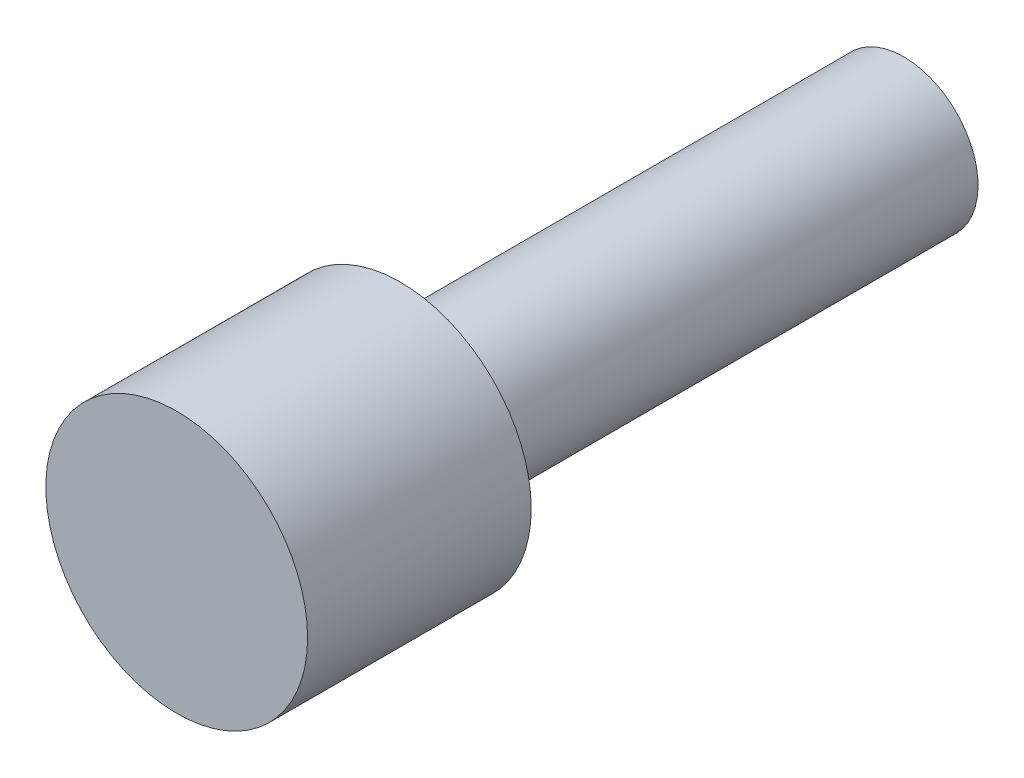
ISO-10303-21;
HEADER;
FILE_DESCRIPTION(('STEP AP214'),'2;1');
FILE_NAME('part.step','',(''),(''),'','','');
FILE_SCHEMA(('AUTOMOTIVE_DESIGN { 1 0 10303 214 1 1 1 1 }'));
ENDSEC;
DATA;
#1=APPLICATION_CONTEXT('core data for automotive mechanical design processes');
#2=APPLICATION_PROTOCOL_DEFINITION('international standard','automotive_design',2000,#1);
#3=PRODUCT_CONTEXT('',#1,'mechanical');
#4=PRODUCT('Part','Part','',(#3));
#5=PRODUCT_RELATED_PRODUCT_CATEGORY('part','',(#4));
#6=PRODUCT_DEFINITION_FORMATION('','',#4);
#7=PRODUCT_DEFINITION_CONTEXT('part definition',#1,'design');
#8=PRODUCT_DEFINITION('design','',#6,#7);
#9=PRODUCT_DEFINITION_SHAPE('','',#8);
#10=(LENGTH_UNIT() NAMED_UNIT(*) SI_UNIT(.MILLI.,.METRE.));
#11=(NAMED_UNIT(*) PLANE_ANGLE_UNIT() SI_UNIT($,.RADIAN.));
#12=(NAMED_UNIT(*) SI_UNIT($,.STERADIAN.) SOLID_ANGLE_UNIT());
#13=UNCERTAINTY_MEASURE_WITH_UNIT(LENGTH_MEASURE(1.E-05),#10,'distance_accuracy_value','');
#14=(GEOMETRIC_REPRESENTATION_CONTEXT(3) GLOBAL_UNCERTAINTY_ASSIGNED_CONTEXT((#13)) GLOBAL_UNIT_ASSIGNED_CONTEXT((#10,
#11,#12)) REPRESENTATION_CONTEXT('',''));
#15=CARTESIAN_POINT('',(0.,0.,0.));
#16=DIRECTION('',(0.,0.,1.));
#17=DIRECTION('',(1.,0.,0.));
#18=AXIS2_PLACEMENT_3D('',#15,#16,#17);
#19=CARTESIAN_POINT('',(0.,0.,-12.2999981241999));
#20=DIRECTION('',(0.,0.,1.));
#21=DIRECTION('',(1.,0.,0.));
#22=AXIS2_PLACEMENT_3D('',#19,#20,#21);
#23=CYLINDRICAL_SURFACE('',#22,7.2);
#24=CARTESIAN_POINT('',(0.,0.,-12.2999981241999));
#25=DIRECTION('',(0.,0.,1.));
#26=DIRECTION('',(1.,0.,0.));
#27=AXIS2_PLACEMENT_3D('',#24,#25,#26);
#28=CIRCLE('',#27,7.2);
#29=CARTESIAN_POINT('',(7.20000000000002,0.,-12.2999981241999));
#30=VERTEX_POINT('',#29);
#31=EDGE_CURVE('E40',#30,#30,#28,.T.);
#32=ORIENTED_EDGE('',*,*,#31,.T.);
#33=EDGE_LOOP('',(#32));
#34=FACE_BOUND('',#33,.T.);
#35=CARTESIAN_POINT('',(0.,0.,0.));
#36=DIRECTION('',(0.,0.,1.));
#37=DIRECTION('',(1.,0.,0.));
#38=AXIS2_PLACEMENT_3D('',#35,#36,#37);
#39=CIRCLE('',#38,7.2);
#40=CARTESIAN_POINT('',(7.20000000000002,0.,0.));
#41=VERTEX_POINT('',#40);
#42=EDGE_CURVE('E36',#41,#41,#39,.T.);
#43=ORIENTED_EDGE('',*,*,#42,.F.);
#44=EDGE_LOOP('',(#43));
#45=FACE_BOUND('',#44,.T.);
#46=ADVANCED_FACE('F33',(#34,#45),#23,.T.);
#47=CARTESIAN_POINT('',(0.,0.,-12.2999981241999));
#48=DIRECTION('',(0.,0.,1.));
#49=DIRECTION('',(1.,0.,0.));
#50=AXIS2_PLACEMENT_3D('',#47,#48,#49);
#51=PLANE('',#50);
#52=CARTESIAN_POINT('',(0.,0.,-12.2999981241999));
#53=DIRECTION('',(0.,0.,-1.));
#54=DIRECTION('',(-1.,0.,0.));
#55=AXIS2_PLACEMENT_3D('',#52,#53,#54);
#56=CIRCLE('',#55,4.08);
#57=CARTESIAN_POINT('',(-4.07999999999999,0.,-12.2999981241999));
#58=VERTEX_POINT('',#57);
#59=EDGE_CURVE('E10',#58,#58,#56,.T.);
#60=ORIENTED_EDGE('',*,*,#59,.F.);
#61=EDGE_LOOP('',(#60));
#62=FACE_BOUND('',#61,.T.);
#63=ORIENTED_EDGE('',*,*,#31,.F.);
#64=EDGE_LOOP('',(#63));
#65=FACE_BOUND('',#64,.T.);
#66=ADVANCED_FACE('F56',(#62,#65),#51,.F.);
#67=CARTESIAN_POINT('',(0.,0.,0.));
#68=DIRECTION('',(0.,0.,1.));
#69=DIRECTION('',(1.,0.,0.));
#70=AXIS2_PLACEMENT_3D('',#67,#68,#69);
#71=PLANE('',#70);
#72=ORIENTED_EDGE('',*,*,#42,.T.);
#73=EDGE_LOOP('',(#72));
#74=FACE_BOUND('',#73,.T.);
#75=ADVANCED_FACE('F53',(#74),#71,.T.);
#76=CARTESIAN_POINT('',(0.,0.,-51.5399826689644));
#77=DIRECTION('',(0.,0.,1.));
#78=DIRECTION('',(1.,0.,0.));
#79=AXIS2_PLACEMENT_3D('',#76,#77,#78);
#80=CYLINDRICAL_SURFACE('',#79,4.08);
#81=ORIENTED_EDGE('',*,*,#59,.T.);
#82=EDGE_LOOP('',(#81));
#83=FACE_BOUND('',#82,.T.);
#84=CARTESIAN_POINT('',(0.,0.,-40.));
#85=DIRECTION('',(0.,0.,-1.));
#86=DIRECTION('',(0.,1.,0.));
#87=AXIS2_PLACEMENT_3D('',#84,#85,#86);
#88=CIRCLE('',#87,4.08);
#89=CARTESIAN_POINT('',(0.,4.08,-40.));
#90=VERTEX_POINT('',#89);
#91=EDGE_CURVE('E46',#90,#90,#88,.T.);
#92=ORIENTED_EDGE('',*,*,#91,.F.);
#93=EDGE_LOOP('',(#92));
#94=FACE_BOUND('',#93,.T.);
#95=ADVANCED_FACE('F68',(#83,#94),#80,.T.);
#96=CARTESIAN_POINT('',(0.,0.,-40.));
#97=DIRECTION('',(0.,0.,-1.));
#98=DIRECTION('',(-1.,0.,0.));
#99=AXIS2_PLACEMENT_3D('',#96,#97,#98);
#100=PLANE('',#99);
#101=ORIENTED_EDGE('',*,*,#91,.T.);
#102=EDGE_LOOP('',(#101));
#103=FACE_BOUND('',#102,.T.);
#104=ADVANCED_FACE('F70',(#103),#100,.T.);
#105=CLOSED_SHELL('',(#46,#66,#75,#95,#104));
#106=MANIFOLD_SOLID_BREP('B2',#105);
#107=ADVANCED_BREP_SHAPE_REPRESENTATION('',(#18,#106),#14);
#108=SHAPE_DEFINITION_REPRESENTATION(#9,#107);
ENDSEC;
END-ISO-10303-21;
